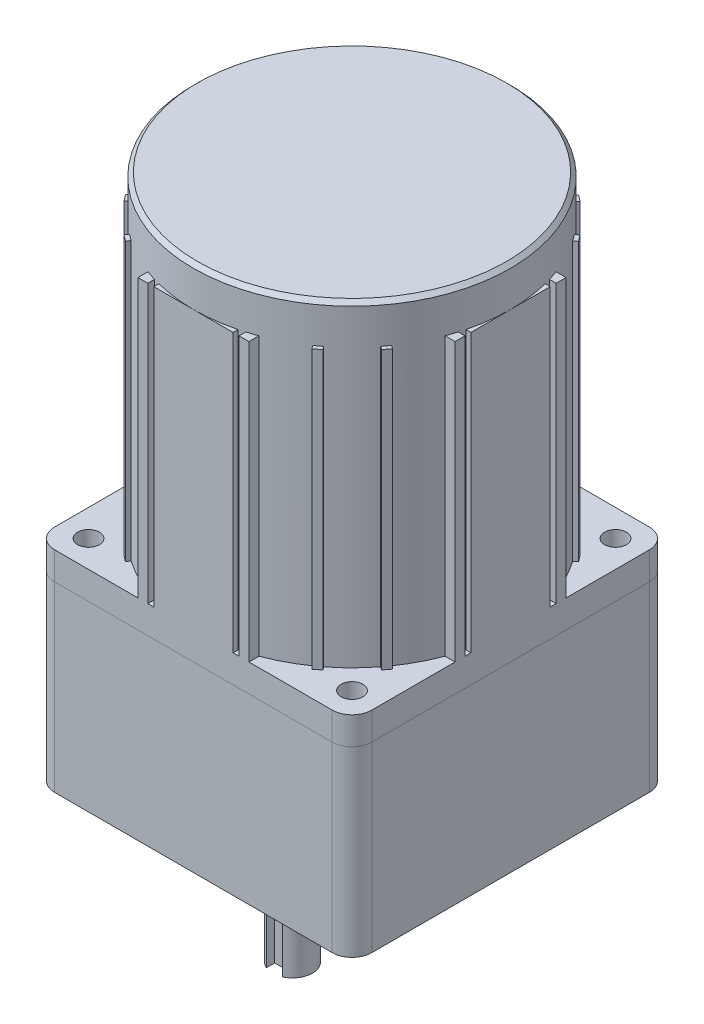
from build123d import *
from build123d.topology import SkipClean

# Parameters (mm, degrees)
SKETCH1_W            = 80
SKETCH1_H            = 80
BOSS_EXTRUDE1_DEPTH  = 87
SKETCH2_OUTSIDE_W    = 110.544
SKETCH2_OUTSIDE_H    = 110.544
SKETCH2_OUTSIDE_R    = 40
CUT_EXTRUDE1_DEPTH   = 10
SKETCH4_R            = 2.25
CUT_EXTRUDE2_DEPTH   = 20
SKETCH5_W            = 80
SKETCH5_H            = 80
BOSS_EXTRUDE2_DEPTH  = 46
SKETCH6_R            = 2.75
CUT_EXTRUDE3_DEPTH   = 175.610996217
SKETCH7_R            = 36.5
CUT_EXTRUDE4_DEPTH   = 2
SKETCH8_R            = 17
BOSS_EXTRUDE3_DEPTH  = 5
SKETCH9_R            = 5
BOSS_EXTRUDE4_DEPTH  = 29
FILLET1_R            = 5
CHAMFER1_SIZE        = 1
CUT_EXTRUDE6_DEPTH   = 70
MIRROR3_COPY_1_DEPTH = 70
FILLET3_R            = 5
CUT_EXTRUDE7_DEPTH   = 2.5


with BuildPart() as part:
    # Sketch1 → Boss-Extrude1 (new body)
    with BuildSketch(Plane(origin=(0, 0, 0), x_dir=(1, 0, 0), z_dir=(0, 1, 0))):
        with Locations((40, -40)):
            Rectangle(SKETCH1_W, SKETCH1_H)
    extrude(amount=BOSS_EXTRUDE1_DEPTH)

    # Sketch2 outside → Cut-Extrude1 (cut)
    with BuildSketch(Plane(origin=(0, 87, 0), x_dir=(1, 0, 0), z_dir=(0, 1, 0))):
        with Locations((40, -40)):
            Rectangle(SKETCH2_OUTSIDE_W, SKETCH2_OUTSIDE_H)
        with Locations(Location((40, -40, 0), (0, 0, 270))):
            Circle(SKETCH2_OUTSIDE_R, mode=Mode.SUBTRACT)
    extrude(amount=-CUT_EXTRUDE1_DEPTH, mode=Mode.SUBTRACT)

    # Sketch4 → Cut-Extrude2 (cut)
    with BuildSketch(Plane.XZ):
        with Locations(Location((64.748737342, 15.251262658, 0), (0, 0, 270))):
            Circle(SKETCH4_R)
        with Locations(Location((15.251262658, 15.251262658, 0), (0, 0, 90))):
            Circle(SKETCH4_R)
        with Locations(Location((15.251262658, 64.748737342, 0), (0, 0, 270))):
            Circle(SKETCH4_R)
        with Locations(Location((64.748737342, 64.748737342, 0), (0, 0, 90))):
            Circle(SKETCH4_R)
    extrude(amount=-CUT_EXTRUDE2_DEPTH, mode=Mode.SUBTRACT)


with BuildPart() as body_2:
    # Sketch5 → Boss-Extrude2 (new body)
    with BuildSketch(Plane(origin=(0, 0, 0), x_dir=(-1, 0, 0), z_dir=(0, -1, 0))):
        with Locations((-40, -40)):
            Rectangle(SKETCH5_W, SKETCH5_H)
    extrude(amount=BOSS_EXTRUDE2_DEPTH)


with BuildPart() as cut_extrude3_tool:
    # Sketch6 → Cut-Extrude3 (new, through all)
    with BuildSketch(Plane.XZ.offset(46)):
        with Locations(Location((6.765981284, 73.234018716, 0), (0, 0, 270))):
            Circle(SKETCH6_R)
        with Locations(Location((6.765981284, 6.765981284, 0), (0, 0, 270))):
            Circle(SKETCH6_R)
        with Locations(Location((73.234018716, 73.234018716, 0), (0, 0, 270))):
            Circle(SKETCH6_R)
        with Locations(Location((73.234018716, 6.765981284, 0), (0, 0, 270))):
            Circle(SKETCH6_R)
    extrude(amount=-CUT_EXTRUDE3_DEPTH)


with BuildPart() as part_1:
    add(part.part)

    # Cut-Extrude3: cut by cut_extrude3_tool
    add(cut_extrude3_tool.part, mode=Mode.SUBTRACT)

    # Chamfer1
    chamfer1_edges = [part_1.edges().sort_by_distance(p)[0] for p in [
        (40, 87, 0),
    ]]
    chamfer(chamfer1_edges, length=CHAMFER1_SIZE)

    # Sketch11 → Cut-Extrude6 (cut)
    with SkipClean():  # the faces are left unmerged after this step: merging them gives an invalid solid
        with BuildSketch(Plane(origin=(0, 77, 0), x_dir=(1, 0, 0), z_dir=(0, 1, 0))):
            with BuildLine():
                Line((0, 0), (0, -26))
                Line((0, -26), (2.53001201, -26))
                ThreePointArc((2.53001201, -26), (4.573898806, -21.426057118), (7.17349773, -17.143474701))
                Line((7.17349773, -17.143474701), (6.31282664, -16.54420432))
                Line((6.31282664, -16.54420432), (7.534265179, -14.960509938))
                Line((7.534265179, -14.960509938), (8.32611237, -15.571229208))
                ThreePointArc((8.32611237, -15.571229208), (11.687111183, -11.744375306), (15.507152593, -8.375635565))
                Line((15.507152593, -8.375635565), (14.894831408, -7.585026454))
                Line((14.894831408, -7.585026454), (16.47604963, -6.360384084))
                Line((16.47604963, -6.360384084), (17.077061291, -7.219840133))
                ThreePointArc((17.077061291, -7.219840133), (21.390204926, -4.59271929), (26, -2.53001201))
                Line((26, -2.53001201), (26, 0))
                Line((26, 0), (0, 0))
            make_face()
            with BuildLine():
                Line((0, -28.5), (0, -30))
                Line((0, -30), (1.270166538, -30))
                ThreePointArc((1.270166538, -30), (1.472169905, -29.247962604), (1.688774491, -28.5))
                Line((1.688774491, -28.5), (0, -28.5))
            make_face()
            with BuildLine():
                Line((30, -1.270166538), (30, 0))
                Line((30, 0), (28.5, 0))
                Line((28.5, 0), (28.5, -1.688774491))
                ThreePointArc((28.5, -1.688774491), (29.247962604, -1.472169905), (30, -1.270166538))
            make_face()
        cut_extrude6 = extrude(amount=-CUT_EXTRUDE6_DEPTH, mode=Mode.SUBTRACT)

    # Mirror1: Cut-Extrude6 across plane
    with SkipClean():  # the faces are left unmerged after this step: merging them gives an invalid solid
        add(cut_extrude6.mirror(Plane(origin=(40, 0, 0), x_dir=(0, 0, 1), z_dir=(1, 0, 0))), mode=Mode.SUBTRACT)

    # Mirror3: Cut-Extrude6 across plane
    with SkipClean():  # the faces are left unmerged after this step: merging them gives an invalid solid
        add(cut_extrude6.mirror(Plane(origin=(0, 0, 40), x_dir=(1, 0, 0), z_dir=(0, 0, -1))), mode=Mode.SUBTRACT)

    # Mirror3 copy 1 sketch → Mirror3 copy 1 (cut)
    with SkipClean():  # the faces are left unmerged after this step: merging them gives an invalid solid
        with BuildSketch(Plane(origin=(80, 77, 80), x_dir=(-1, 0, 0), z_dir=(0, 1, 0))):
            with BuildLine():
                Line((0, 0), (0, -26))
                Line((0, -26), (2.53001201, -26))
                ThreePointArc((2.53001201, -26), (4.573898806, -21.426057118), (7.17349773, -17.143474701))
                Line((7.17349773, -17.143474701), (6.31282664, -16.54420432))
                Line((6.31282664, -16.54420432), (7.534265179, -14.960509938))
                Line((7.534265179, -14.960509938), (8.32611237, -15.571229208))
                ThreePointArc((8.32611237, -15.571229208), (11.687111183, -11.744375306), (15.507152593, -8.375635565))
                Line((15.507152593, -8.375635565), (14.894831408, -7.585026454))
                Line((14.894831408, -7.585026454), (16.47604963, -6.360384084))
                Line((16.47604963, -6.360384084), (17.077061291, -7.219840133))
                ThreePointArc((17.077061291, -7.219840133), (21.390204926, -4.59271929), (26, -2.53001201))
                Line((26, -2.53001201), (26, 0))
                Line((26, 0), (0, 0))
            make_face()
            with BuildLine():
                Line((0, -28.5), (0, -30))
                Line((0, -30), (1.270166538, -30))
                ThreePointArc((1.270166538, -30), (1.472169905, -29.247962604), (1.688774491, -28.5))
                Line((1.688774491, -28.5), (0, -28.5))
            make_face()
            with BuildLine():
                Line((30, -1.270166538), (30, 0))
                Line((30, 0), (28.5, 0))
                Line((28.5, 0), (28.5, -1.688774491))
                ThreePointArc((28.5, -1.688774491), (29.247962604, -1.472169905), (30, -1.270166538))
            make_face()
        extrude(amount=-MIRROR3_COPY_1_DEPTH, mode=Mode.SUBTRACT)

    # Fillet3
    fillet3_edges = [part_1.edges().sort_by_distance(p)[0] for p in [
        (0, 3.5, 0),
        (80, 3.5, 0),
        (0, 3.5, 80),
        (80, 3.5, 80),
    ]]
    fillet(fillet3_edges, radius=FILLET3_R)


with BuildPart() as body_2_1:
    add(body_2.part)

    # Cut-Extrude3: cut by cut_extrude3_tool
    add(cut_extrude3_tool.part, mode=Mode.SUBTRACT)

    # Sketch7 → Cut-Extrude4 (cut)
    with BuildSketch(Plane.XZ.offset(46)):
        with Locations(Location((40, 40, 0), (0, 0, 270))):
            Circle(SKETCH7_R)
    extrude(amount=-CUT_EXTRUDE4_DEPTH, mode=Mode.SUBTRACT)

    # Sketch8 → Boss-Extrude3 (add)
    with BuildSketch(Plane.XZ.offset(44)):
        with Locations(Location((40, 55, 0), (0, 0, 270))):
            Circle(SKETCH8_R)
    extrude(amount=BOSS_EXTRUDE3_DEPTH)

    # Sketch9 → Boss-Extrude4 (add)
    with BuildSketch(Plane(origin=(0, -49, 0), x_dir=(-1, 0, 0), z_dir=(0, -1, 0))):
        with Locations(Location((-40, -55, 0), (0, 0, 270))):
            Circle(SKETCH9_R)
    extrude(amount=BOSS_EXTRUDE4_DEPTH)

    # Fillet1
    fillet1_edges = [body_2_1.edges().sort_by_distance(p)[0] for p in [
        (0, -23, 80),
        (80, -23, 80),
        (80, -23, 0),
        (0, -23, 0),
    ]]
    fillet(fillet1_edges, radius=FILLET1_R)

    # Sketch12 → Cut-Extrude7 (cut)
    with BuildSketch(Plane.XY.offset(60)):
        with BuildLine():
            Line((38, -78), (38, -55))
            ThreePointArc((38, -55), (40, -53), (42, -55))
            Line((42, -55), (42, -78))
            ThreePointArc((42, -78), (40, -80), (38, -78))
        make_face()
    extrude(amount=-CUT_EXTRUDE7_DEPTH, mode=Mode.SUBTRACT)


solid = Compound([part_1.part, body_2_1.part])
